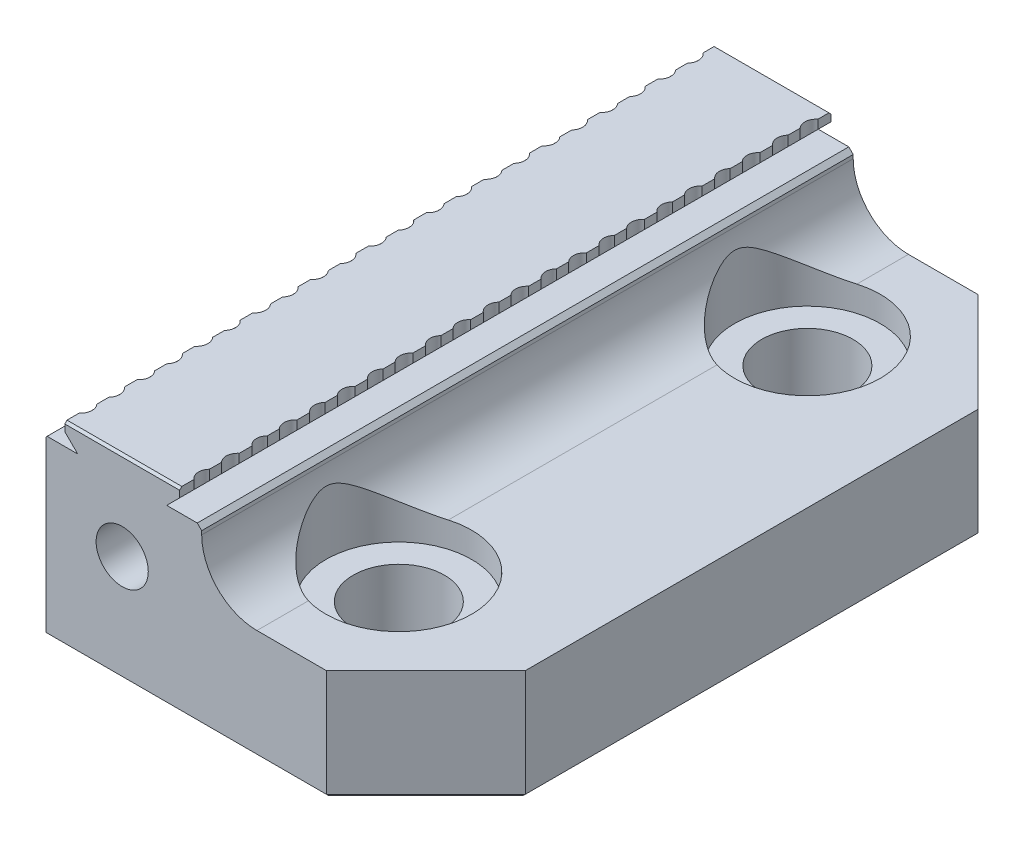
from build123d import *

# Parameters (mm, degrees)
BOSS_EXTRUDE1_DEPTH                = 37.465
CUT_EXTRUDE1_JAW_TOOTH_REACH       = 50.933
LPATTERN1_COUNT                    = 11
LPATTERN1_PITCH                    = 6.6548
CBORE_FOR_M10_SHCS1_D              = 10.5
CBORE_FOR_M10_SHCS1_CBORE_D        = 16.764
CBORE_FOR_M10_SHCS1_CBORE_DEPTH    = 12.7
F_6_0MM_DOWEL_HOLE1_D              = 8.0127
F_6_0MM_DOWEL_HOLE1_DEPTH          = 6.858
CHAMFER1_SIZE                      = 11.43
CHAMFER2_SIZE                      = 0.254
OUTSIDE_DOVETAIL_CHAMFER_SIZE      = 0.508
INSIDE_DOVETAIL_CHAMFER_SIZE       = 0.508
BOTTOM_OUTSIDE_EDGE_CHAMFER_SIZE   = 0.381
OUTSIDE_JAW_FACE_EDGE_CHAMFER_SIZE = 0.381
FRONT_JAW_FACE_CHAMFERED_EDGE_SIZE = 0.381


with BuildPart() as part:
    # Sketch1 → Boss-Extrude1 (new, symmetric)
    with BuildSketch(Plane.XY):
        with BuildLine():
            Line((-22.0345, -11.2395), (22.0345, -11.2395))
            Line((22.0345, -11.2395), (22.0345, 1.4605))
            Line((22.0345, 1.4605), (2.6035, 1.4605))
            ThreePointArc((2.6035, 1.4605), (-1.886628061, 3.320371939), (-3.7465, 7.8105))
            Line((-3.7465, 7.8105), (-3.7465, 8.7395))
            Line((-3.7465, 8.7395), (-7.7705, 8.7395))
            Line((-7.7705, 8.7395), (-6.2865, 10.2235))
            Line((-6.2865, 10.2235), (-6.2865, 11.2395))
            Line((-6.2865, 11.2395), (-19.4945, 11.2395))
            Line((-19.4945, 11.2395), (-19.4945, 10.2235))
            Line((-19.4945, 10.2235), (-18.0105, 8.7395))
            Line((-18.0105, 8.7395), (-22.0345, 8.7395))
            Line((-22.0345, 8.7395), (-22.0345, -11.2395))
        make_face()
    extrude(amount=BOSS_EXTRUDE1_DEPTH, both=True)

    # Sketch8 → Cut-Extrude1 JAW TOOTH (cut, up to next)
    with BuildSketch(Plane(origin=(0, 11.2395, 0), x_dir=(1, 0, 0), z_dir=(0, 1, 0)), mode=Mode.PRIVATE) as cut_extrude1_jaw_tooth_sk1:
        with BuildLine():
            Line((-19.4945, 37.465), (-19.4945, 35.941))
            ThreePointArc((-19.4945, 35.941), (-19.015440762, 35.013590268), (-19.3675, 34.03092))
            Line((-19.3675, 34.03092), (-19.3675, 32.64408))
            ThreePointArc((-19.3675, 32.64408), (-19.015440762, 31.661409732), (-19.4945, 30.734))
            Line((-19.4945, 30.734), (-22.233870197, 30.734))
            Line((-22.233870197, 30.734), (-22.233870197, 37.465))
            Line((-22.233870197, 37.465), (-19.4945, 37.465))
        make_face()
    cut_extrude1_jaw_tooth_tool1 = extrude(cut_extrude1_jaw_tooth_sk1.sketch, amount=-CUT_EXTRUDE1_JAW_TOOTH_REACH, mode=Mode.PRIVATE) & part.part
    # Sketch8 → Cut-Extrude1 JAW TOOTH (cut, up to next)
    with BuildSketch(Plane(origin=(0, 11.2395, 0), x_dir=(1, 0, 0), z_dir=(0, 1, 0)), mode=Mode.PRIVATE) as cut_extrude1_jaw_tooth_sk2:
        with BuildLine():
            Line((-3.547129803, 37.465), (-6.2865, 37.465))
            Line((-6.2865, 37.465), (-6.2865, 35.941))
            ThreePointArc((-6.2865, 35.941), (-6.765559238, 35.013590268), (-6.4135, 34.03092))
            Line((-6.4135, 34.03092), (-6.4135, 32.64408))
            ThreePointArc((-6.4135, 32.64408), (-6.765559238, 31.661409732), (-6.2865, 30.734))
            Line((-6.2865, 30.734), (-3.547129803, 30.734))
            Line((-3.547129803, 30.734), (-3.547129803, 37.465))
        make_face()
    cut_extrude1_jaw_tooth_tool2 = extrude(cut_extrude1_jaw_tooth_sk2.sketch, amount=-CUT_EXTRUDE1_JAW_TOOTH_REACH, mode=Mode.PRIVATE) & part.part
    cut_extrude1_jaw_tooth_1 = cut_extrude1_jaw_tooth_tool1.solids().sort_by_distance((-20.745914, 11.2395, -34.041435))[0]
    add(cut_extrude1_jaw_tooth_1, mode=Mode.SUBTRACT)
    cut_extrude1_jaw_tooth_2 = cut_extrude1_jaw_tooth_tool2.solids().sort_by_distance((-5.035086, 11.2395, -34.041435))[0]
    add(cut_extrude1_jaw_tooth_2, mode=Mode.SUBTRACT)
    cut_extrude1_jaw_tooth = cut_extrude1_jaw_tooth_1 + cut_extrude1_jaw_tooth_2  # Cut-Extrude1 JAW TOOTH as one shape, for the pattern or mirror that repeats it

    # LPattern1: Cut-Extrude1 JAW TOOTH ×11
    with Locations(*[(0, 0, i * LPATTERN1_PITCH) for i in range(1, LPATTERN1_COUNT)]):
        add(cut_extrude1_jaw_tooth, mode=Mode.SUBTRACT)

    # CBORE for M10 SHCS1 (through all)
    with Locations(Plane(origin=(0, 11.2395, 0), x_dir=(-1, 0, 0), z_dir=(0, 1, 0))):
        with Locations((-4.953, -23.495), (-4.953, 23.495)):
            CounterBoreHole(CBORE_FOR_M10_SHCS1_D / 2, CBORE_FOR_M10_SHCS1_CBORE_D / 2, CBORE_FOR_M10_SHCS1_CBORE_DEPTH)

    # 6.0mm Dowel Hole1
    with Locations(Plane.XZ.offset(11.2395)):
        with Locations((16.653, 23.5), (-6.747, -23.5)):
            Hole(F_6_0MM_DOWEL_HOLE1_D / 2, depth=F_6_0MM_DOWEL_HOLE1_DEPTH)

    # Chamfer1
    chamfer1_edges = [part.edges().sort_by_distance(p)[0] for p in [
        (22.0345, -4.8895, 37.465),
        (22.0345, -4.8895, -37.465),
    ]]
    chamfer(chamfer1_edges, length=CHAMFER1_SIZE)

    # Chamfer2
    chamfer2_edges = [part.edges().sort_by_distance(p)[0] for p in [
        (-12.8905, 11.2395, -37.465),
        (-12.8905, 11.2395, 37.465),
    ]]
    chamfer(chamfer2_edges, length=CHAMFER2_SIZE)

    # Sketch13 → M6x1.0 Tapped Hole1 (revolve, cut)
    with BuildSketch(Plane(origin=(-12.8905, 1.0795, -37.465), x_dir=(0, 1, 0), z_dir=(1, 0, 0))):
        Polygon((0, 0), (0, 16.488151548), (2.5, 14.986), (2.5, 11.9888), (3, 11.9888), (3, 0), align=None)
    m6x1_0_tapped_hole1 = revolve(axis=Axis((-12.8905, 1.0795, -43.815), (0, 0, 1)), mode=Mode.SUBTRACT)

    # Mirror1: M6x1.0 Tapped Hole1 across plane
    add(m6x1_0_tapped_hole1.mirror(Plane.XY), mode=Mode.SUBTRACT)

    # OUTSIDE DOVETAIL CHAMFER
    outside_dovetail_chamfer_edges = [part.edges().sort_by_distance(p)[0] for p in [
        (-22.0345, 8.7395, 0),
    ]]
    chamfer(outside_dovetail_chamfer_edges, length=OUTSIDE_DOVETAIL_CHAMFER_SIZE)

    # INSIDE DOVETAIL CHAMFER
    inside_dovetail_chamfer_edges = [part.edges().sort_by_distance(p)[0] for p in [
        (-3.7465, 8.7395, 0),
    ]]
    chamfer(inside_dovetail_chamfer_edges, length=INSIDE_DOVETAIL_CHAMFER_SIZE)

    # BOTTOM OUTSIDE EDGE CHAMFER
    bottom_outside_edge_chamfer_edges = [part.edges().sort_by_distance(p)[0] for p in [
        (-5.715, -11.2395, -37.465),
        (-0.297, -11.2395, 23.495),
        (-0.297, -11.2395, -23.495),
        (22.0345, -11.2395, 0),
        (16.3195, -11.2395, 31.75),
        (16.3195, -11.2395, -31.75),
        (-5.715, -11.2395, 37.465),
    ]]
    chamfer(bottom_outside_edge_chamfer_edges, length=BOTTOM_OUTSIDE_EDGE_CHAMFER_SIZE)

    # OUTSIDE JAW FACE EDGE CHAMFER
    outside_jaw_face_edge_chamfer_edges = [part.edges().sort_by_distance(p)[0] for p in [
        (-22.0345, -1.3135, -37.465),
        (-22.0345, -1.3135, 37.465),
    ]]
    chamfer(outside_jaw_face_edge_chamfer_edges, length=OUTSIDE_JAW_FACE_EDGE_CHAMFER_SIZE)

    # FRONT JAW FACE CHAMFERED EDGE
    front_jaw_face_chamfered_edge_edges = [part.edges().sort_by_distance(p)[0] for p in [
        (-22.0345, -11.2395, 0),
    ]]
    chamfer(front_jaw_face_chamfered_edge_edges, length=FRONT_JAW_FACE_CHAMFERED_EDGE_SIZE)


solid = part.part
